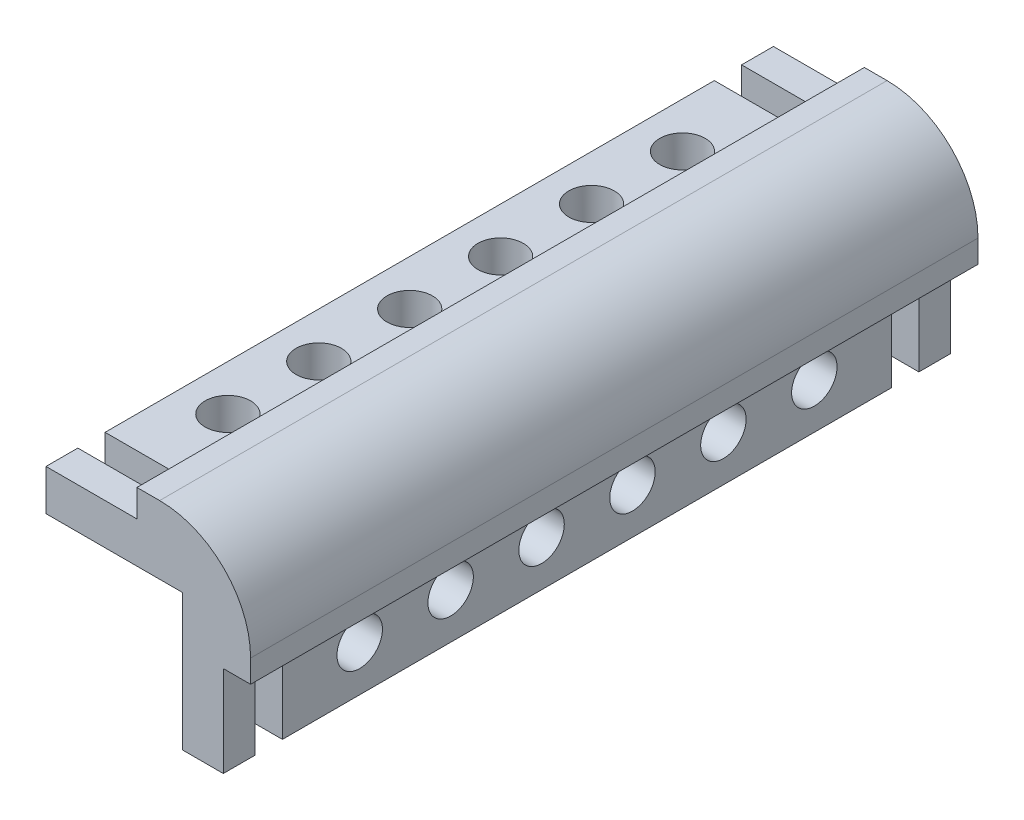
ISO-10303-21;
HEADER;
FILE_DESCRIPTION(('STEP AP214'),'2;1');
FILE_NAME('part.step','',(''),(''),'','','');
FILE_SCHEMA(('AUTOMOTIVE_DESIGN { 1 0 10303 214 1 1 1 1 }'));
ENDSEC;
DATA;
#1=APPLICATION_CONTEXT('core data for automotive mechanical design processes');
#2=APPLICATION_PROTOCOL_DEFINITION('international standard','automotive_design',2000,#1);
#3=PRODUCT_CONTEXT('',#1,'mechanical');
#4=PRODUCT('Part','Part','',(#3));
#5=PRODUCT_RELATED_PRODUCT_CATEGORY('part','',(#4));
#6=PRODUCT_DEFINITION_FORMATION('','',#4);
#7=PRODUCT_DEFINITION_CONTEXT('part definition',#1,'design');
#8=PRODUCT_DEFINITION('design','',#6,#7);
#9=PRODUCT_DEFINITION_SHAPE('','',#8);
#10=(LENGTH_UNIT() NAMED_UNIT(*) SI_UNIT(.MILLI.,.METRE.));
#11=(NAMED_UNIT(*) PLANE_ANGLE_UNIT() SI_UNIT($,.RADIAN.));
#12=(NAMED_UNIT(*) SI_UNIT($,.STERADIAN.) SOLID_ANGLE_UNIT());
#13=UNCERTAINTY_MEASURE_WITH_UNIT(LENGTH_MEASURE(1.E-05),#10,'distance_accuracy_value','');
#14=(GEOMETRIC_REPRESENTATION_CONTEXT(3) GLOBAL_UNCERTAINTY_ASSIGNED_CONTEXT((#13)) GLOBAL_UNIT_ASSIGNED_CONTEXT((#10,
#11,#12)) REPRESENTATION_CONTEXT('',''));
#15=CARTESIAN_POINT('',(0.,0.,0.));
#16=DIRECTION('',(0.,0.,1.));
#17=DIRECTION('',(1.,0.,0.));
#18=AXIS2_PLACEMENT_3D('',#15,#16,#17);
#19=CARTESIAN_POINT('',(30.,0.,80.));
#20=DIRECTION('',(1.,0.,0.));
#21=DIRECTION('',(0.,1.,0.));
#22=AXIS2_PLACEMENT_3D('',#19,#20,#21);
#23=PLANE('',#22);
#24=CARTESIAN_POINT('',(30.,-20.,10.));
#25=DIRECTION('',(1.,0.,0.));
#26=DIRECTION('',(0.,1.,0.));
#27=AXIS2_PLACEMENT_3D('',#24,#25,#26);
#28=CIRCLE('',#27,5.);
#29=CARTESIAN_POINT('',(30.,-15.,10.));
#30=VERTEX_POINT('',#29);
#31=EDGE_CURVE('E549',#30,#30,#28,.T.);
#32=ORIENTED_EDGE('',*,*,#31,.T.);
#33=EDGE_LOOP('',(#32));
#34=FACE_BOUND('',#33,.T.);
#35=CARTESIAN_POINT('',(30.,-20.,-10.));
#36=DIRECTION('',(1.,0.,0.));
#37=DIRECTION('',(0.,1.,0.));
#38=AXIS2_PLACEMENT_3D('',#35,#36,#37);
#39=CIRCLE('',#38,5.00000000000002);
#40=CARTESIAN_POINT('',(30.,-15.,-10.));
#41=VERTEX_POINT('',#40);
#42=EDGE_CURVE('E546',#41,#41,#39,.T.);
#43=ORIENTED_EDGE('',*,*,#42,.T.);
#44=EDGE_LOOP('',(#43));
#45=FACE_BOUND('',#44,.T.);
#46=CARTESIAN_POINT('',(30.,-20.,50.));
#47=DIRECTION('',(1.,0.,0.));
#48=DIRECTION('',(0.,1.,0.));
#49=AXIS2_PLACEMENT_3D('',#46,#47,#48);
#50=CIRCLE('',#49,4.99999999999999);
#51=CARTESIAN_POINT('',(30.,-15.,50.));
#52=VERTEX_POINT('',#51);
#53=EDGE_CURVE('E543',#52,#52,#50,.T.);
#54=ORIENTED_EDGE('',*,*,#53,.T.);
#55=EDGE_LOOP('',(#54));
#56=FACE_BOUND('',#55,.T.);
#57=CARTESIAN_POINT('',(30.,-20.,30.));
#58=DIRECTION('',(1.,0.,0.));
#59=DIRECTION('',(0.,1.,0.));
#60=AXIS2_PLACEMENT_3D('',#57,#58,#59);
#61=CIRCLE('',#60,4.99999999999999);
#62=CARTESIAN_POINT('',(30.,-15.,30.));
#63=VERTEX_POINT('',#62);
#64=EDGE_CURVE('E540',#63,#63,#61,.T.);
#65=ORIENTED_EDGE('',*,*,#64,.T.);
#66=EDGE_LOOP('',(#65));
#67=FACE_BOUND('',#66,.T.);
#68=CARTESIAN_POINT('',(30.,-20.,-30.));
#69=DIRECTION('',(1.,0.,0.));
#70=DIRECTION('',(0.,1.,0.));
#71=AXIS2_PLACEMENT_3D('',#68,#69,#70);
#72=CIRCLE('',#71,5.);
#73=CARTESIAN_POINT('',(30.,-15.,-30.));
#74=VERTEX_POINT('',#73);
#75=EDGE_CURVE('E535',#74,#74,#72,.T.);
#76=ORIENTED_EDGE('',*,*,#75,.T.);
#77=EDGE_LOOP('',(#76));
#78=FACE_BOUND('',#77,.T.);
#79=CARTESIAN_POINT('',(30.,-20.,-50.));
#80=DIRECTION('',(1.,0.,0.));
#81=DIRECTION('',(0.,1.,0.));
#82=AXIS2_PLACEMENT_3D('',#79,#80,#81);
#83=CIRCLE('',#82,5.);
#84=CARTESIAN_POINT('',(30.,-15.,-50.));
#85=VERTEX_POINT('',#84);
#86=EDGE_CURVE('E265',#85,#85,#83,.T.);
#87=ORIENTED_EDGE('',*,*,#86,.T.);
#88=EDGE_LOOP('',(#87));
#89=FACE_BOUND('',#88,.T.);
#90=DIRECTION('',(0.,1.,0.));
#91=VECTOR('',#90,1.);
#92=CARTESIAN_POINT('',(30.,0.,-67.));
#93=LINE('',#92,#91);
#94=CARTESIAN_POINT('',(30.,-30.,-67.));
#95=VERTEX_POINT('',#94);
#96=CARTESIAN_POINT('',(30.,0.,-67.));
#97=VERTEX_POINT('',#96);
#98=EDGE_CURVE('E456',#95,#97,#93,.T.);
#99=ORIENTED_EDGE('',*,*,#98,.F.);
#100=DIRECTION('',(0.,0.,-1.));
#101=VECTOR('',#100,1.);
#102=CARTESIAN_POINT('',(30.,-30.,80.));
#103=LINE('',#102,#101);
#104=CARTESIAN_POINT('',(30.,-30.,67.));
#105=VERTEX_POINT('',#104);
#106=EDGE_CURVE('E309',#105,#95,#103,.T.);
#107=ORIENTED_EDGE('',*,*,#106,.F.);
#108=DIRECTION('',(0.,1.,0.));
#109=VECTOR('',#108,1.);
#110=CARTESIAN_POINT('',(30.,0.,67.));
#111=LINE('',#110,#109);
#112=CARTESIAN_POINT('',(30.,0.,67.));
#113=VERTEX_POINT('',#112);
#114=EDGE_CURVE('E476',#105,#113,#111,.T.);
#115=ORIENTED_EDGE('',*,*,#114,.T.);
#116=DIRECTION('',(0.,0.,-1.));
#117=VECTOR('',#116,1.);
#118=CARTESIAN_POINT('',(30.,0.,80.));
#119=LINE('',#118,#117);
#120=EDGE_CURVE('E318',#113,#97,#119,.T.);
#121=ORIENTED_EDGE('',*,*,#120,.T.);
#122=EDGE_LOOP('',(#99,#107,#115,#121));
#123=FACE_BOUND('',#122,.T.);
#124=ADVANCED_FACE('F45',(#34,#45,#56,#67,#78,#89,#123),#23,.F.);
#125=CARTESIAN_POINT('',(45.,-30.,80.));
#126=DIRECTION('',(0.,-1.,0.));
#127=DIRECTION('',(1.,0.,0.));
#128=AXIS2_PLACEMENT_3D('',#125,#126,#127);
#129=PLANE('',#128);
#130=ORIENTED_EDGE('',*,*,#106,.T.);
#131=DIRECTION('',(1.,0.,0.));
#132=VECTOR('',#131,1.);
#133=CARTESIAN_POINT('',(45.,-30.,-67.));
#134=LINE('',#133,#132);
#135=CARTESIAN_POINT('',(39.,-30.,-67.));
#136=VERTEX_POINT('',#135);
#137=EDGE_CURVE('E458',#95,#136,#134,.T.);
#138=ORIENTED_EDGE('',*,*,#137,.T.);
#139=DIRECTION('',(0.,0.,1.));
#140=VECTOR('',#139,1.);
#141=CARTESIAN_POINT('',(39.,-30.,-80.));
#142=LINE('',#141,#140);
#143=CARTESIAN_POINT('',(39.,-30.,67.));
#144=VERTEX_POINT('',#143);
#145=EDGE_CURVE('E371',#136,#144,#142,.T.);
#146=ORIENTED_EDGE('',*,*,#145,.T.);
#147=DIRECTION('',(1.,0.,0.));
#148=VECTOR('',#147,1.);
#149=CARTESIAN_POINT('',(45.,-30.,67.));
#150=LINE('',#149,#148);
#151=EDGE_CURVE('E479',#105,#144,#150,.T.);
#152=ORIENTED_EDGE('',*,*,#151,.F.);
#153=EDGE_LOOP('',(#130,#138,#146,#152));
#154=FACE_BOUND('',#153,.T.);
#155=ADVANCED_FACE('F576',(#154),#129,.T.);
#156=CARTESIAN_POINT('',(0.,0.,80.));
#157=DIRECTION('',(-1.,0.,0.));
#158=DIRECTION('',(0.,0.,1.));
#159=AXIS2_PLACEMENT_3D('',#156,#157,#158);
#160=PLANE('',#159);
#161=DIRECTION('',(0.,0.,1.));
#162=VECTOR('',#161,1.);
#163=CARTESIAN_POINT('',(0.,9.,-80.));
#164=LINE('',#163,#162);
#165=CARTESIAN_POINT('',(0.,9.,-67.));
#166=VERTEX_POINT('',#165);
#167=CARTESIAN_POINT('',(0.,9.,67.));
#168=VERTEX_POINT('',#167);
#169=EDGE_CURVE('E248',#166,#168,#164,.T.);
#170=ORIENTED_EDGE('',*,*,#169,.F.);
#171=DIRECTION('',(0.,-1.,0.));
#172=VECTOR('',#171,1.);
#173=CARTESIAN_POINT('',(0.,48.4588393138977,-67.));
#174=LINE('',#173,#172);
#175=CARTESIAN_POINT('',(0.,0.,-67.));
#176=VERTEX_POINT('',#175);
#177=EDGE_CURVE('E242',#166,#176,#174,.T.);
#178=ORIENTED_EDGE('',*,*,#177,.T.);
#179=DIRECTION('',(0.,0.,-1.));
#180=VECTOR('',#179,1.);
#181=CARTESIAN_POINT('',(0.,0.,80.));
#182=LINE('',#181,#180);
#183=CARTESIAN_POINT('',(0.,0.,67.));
#184=VERTEX_POINT('',#183);
#185=EDGE_CURVE('E314',#184,#176,#182,.T.);
#186=ORIENTED_EDGE('',*,*,#185,.F.);
#187=DIRECTION('',(0.,-1.,0.));
#188=VECTOR('',#187,1.);
#189=CARTESIAN_POINT('',(0.,48.4588393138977,67.));
#190=LINE('',#189,#188);
#191=EDGE_CURVE('E443',#168,#184,#190,.T.);
#192=ORIENTED_EDGE('',*,*,#191,.F.);
#193=EDGE_LOOP('',(#170,#178,#186,#192));
#194=FACE_BOUND('',#193,.T.);
#195=ADVANCED_FACE('F442',(#194),#160,.T.);
#196=CARTESIAN_POINT('',(0.,0.,80.));
#197=DIRECTION('',(0.,1.,0.));
#198=DIRECTION('',(0.,0.,1.));
#199=AXIS2_PLACEMENT_3D('',#196,#197,#198);
#200=PLANE('',#199);
#201=CARTESIAN_POINT('',(9.99999999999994,0.,30.));
#202=DIRECTION('',(0.,1.,0.));
#203=DIRECTION('',(0.,0.,1.));
#204=AXIS2_PLACEMENT_3D('',#201,#202,#203);
#205=CIRCLE('',#204,5.);
#206=CARTESIAN_POINT('',(9.99999999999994,0.,35.));
#207=VERTEX_POINT('',#206);
#208=EDGE_CURVE('E513',#207,#207,#205,.T.);
#209=ORIENTED_EDGE('',*,*,#208,.T.);
#210=EDGE_LOOP('',(#209));
#211=FACE_BOUND('',#210,.T.);
#212=CARTESIAN_POINT('',(9.99999999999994,0.,9.99999999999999));
#213=DIRECTION('',(0.,1.,0.));
#214=DIRECTION('',(0.,0.,1.));
#215=AXIS2_PLACEMENT_3D('',#212,#213,#214);
#216=CIRCLE('',#215,5.);
#217=CARTESIAN_POINT('',(9.99999999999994,0.,15.));
#218=VERTEX_POINT('',#217);
#219=EDGE_CURVE('E510',#218,#218,#216,.T.);
#220=ORIENTED_EDGE('',*,*,#219,.T.);
#221=EDGE_LOOP('',(#220));
#222=FACE_BOUND('',#221,.T.);
#223=CARTESIAN_POINT('',(9.99999999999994,0.,-9.99999999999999));
#224=DIRECTION('',(0.,1.,0.));
#225=DIRECTION('',(0.,0.,1.));
#226=AXIS2_PLACEMENT_3D('',#223,#224,#225);
#227=CIRCLE('',#226,5.);
#228=CARTESIAN_POINT('',(9.99999999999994,0.,-4.99999999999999));
#229=VERTEX_POINT('',#228);
#230=EDGE_CURVE('E507',#229,#229,#227,.T.);
#231=ORIENTED_EDGE('',*,*,#230,.T.);
#232=EDGE_LOOP('',(#231));
#233=FACE_BOUND('',#232,.T.);
#234=CARTESIAN_POINT('',(9.99999999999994,0.,-30.));
#235=DIRECTION('',(0.,1.,0.));
#236=DIRECTION('',(0.,0.,1.));
#237=AXIS2_PLACEMENT_3D('',#234,#235,#236);
#238=CIRCLE('',#237,5.);
#239=CARTESIAN_POINT('',(9.99999999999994,0.,-25.));
#240=VERTEX_POINT('',#239);
#241=EDGE_CURVE('E504',#240,#240,#238,.T.);
#242=ORIENTED_EDGE('',*,*,#241,.T.);
#243=EDGE_LOOP('',(#242));
#244=FACE_BOUND('',#243,.T.);
#245=CARTESIAN_POINT('',(9.99999999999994,0.,-50.));
#246=DIRECTION('',(0.,1.,0.));
#247=DIRECTION('',(0.,0.,1.));
#248=AXIS2_PLACEMENT_3D('',#245,#246,#247);
#249=CIRCLE('',#248,5.);
#250=CARTESIAN_POINT('',(9.99999999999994,0.,-45.));
#251=VERTEX_POINT('',#250);
#252=EDGE_CURVE('E490',#251,#251,#249,.T.);
#253=ORIENTED_EDGE('',*,*,#252,.T.);
#254=EDGE_LOOP('',(#253));
#255=FACE_BOUND('',#254,.T.);
#256=CARTESIAN_POINT('',(9.99999999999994,0.,50.));
#257=DIRECTION('',(0.,1.,0.));
#258=DIRECTION('',(0.,0.,1.));
#259=AXIS2_PLACEMENT_3D('',#256,#257,#258);
#260=CIRCLE('',#259,5.);
#261=CARTESIAN_POINT('',(9.99999999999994,0.,55.));
#262=VERTEX_POINT('',#261);
#263=EDGE_CURVE('E519',#262,#262,#260,.T.);
#264=ORIENTED_EDGE('',*,*,#263,.T.);
#265=EDGE_LOOP('',(#264));
#266=FACE_BOUND('',#265,.T.);
#267=DIRECTION('',(-1.,0.,0.));
#268=VECTOR('',#267,1.);
#269=CARTESIAN_POINT('',(0.,0.,-67.));
#270=LINE('',#269,#268);
#271=EDGE_CURVE('E437',#97,#176,#270,.T.);
#272=ORIENTED_EDGE('',*,*,#271,.F.);
#273=ORIENTED_EDGE('',*,*,#120,.F.);
#274=DIRECTION('',(-1.,0.,0.));
#275=VECTOR('',#274,1.);
#276=CARTESIAN_POINT('',(0.,0.,67.));
#277=LINE('',#276,#275);
#278=EDGE_CURVE('E439',#113,#184,#277,.T.);
#279=ORIENTED_EDGE('',*,*,#278,.T.);
#280=ORIENTED_EDGE('',*,*,#185,.T.);
#281=EDGE_LOOP('',(#272,#273,#279,#280));
#282=FACE_BOUND('',#281,.T.);
#283=ADVANCED_FACE('F435',(#211,#222,#233,#244,#255,#266,#282),#200,.F.);
#284=CARTESIAN_POINT('',(39.,-9.99999999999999,-80.));
#285=DIRECTION('',(-1.,0.,0.));
#286=DIRECTION('',(0.,-1.,0.));
#287=AXIS2_PLACEMENT_3D('',#284,#285,#286);
#288=PLANE('',#287);
#289=CARTESIAN_POINT('',(39.,-20.,10.));
#290=DIRECTION('',(1.,0.,0.));
#291=DIRECTION('',(0.,-1.,0.));
#292=AXIS2_PLACEMENT_3D('',#289,#290,#291);
#293=CIRCLE('',#292,5.);
#294=CARTESIAN_POINT('',(39.,-25.,10.));
#295=VERTEX_POINT('',#294);
#296=EDGE_CURVE('E522',#295,#295,#293,.T.);
#297=ORIENTED_EDGE('',*,*,#296,.F.);
#298=EDGE_LOOP('',(#297));
#299=FACE_BOUND('',#298,.T.);
#300=CARTESIAN_POINT('',(39.,-20.,-10.));
#301=DIRECTION('',(1.,0.,0.));
#302=DIRECTION('',(0.,1.,0.));
#303=AXIS2_PLACEMENT_3D('',#300,#301,#302);
#304=CIRCLE('',#303,5.00000000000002);
#305=CARTESIAN_POINT('',(39.,-15.,-10.));
#306=VERTEX_POINT('',#305);
#307=EDGE_CURVE('E527',#306,#306,#304,.T.);
#308=ORIENTED_EDGE('',*,*,#307,.F.);
#309=EDGE_LOOP('',(#308));
#310=FACE_BOUND('',#309,.T.);
#311=CARTESIAN_POINT('',(39.,-20.,50.));
#312=DIRECTION('',(1.,0.,0.));
#313=DIRECTION('',(0.,-1.,0.));
#314=AXIS2_PLACEMENT_3D('',#311,#312,#313);
#315=CIRCLE('',#314,4.99999999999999);
#316=CARTESIAN_POINT('',(39.,-25.,50.));
#317=VERTEX_POINT('',#316);
#318=EDGE_CURVE('E523',#317,#317,#315,.T.);
#319=ORIENTED_EDGE('',*,*,#318,.F.);
#320=EDGE_LOOP('',(#319));
#321=FACE_BOUND('',#320,.T.);
#322=CARTESIAN_POINT('',(39.,-20.,30.));
#323=DIRECTION('',(1.,0.,0.));
#324=DIRECTION('',(0.,-1.,0.));
#325=AXIS2_PLACEMENT_3D('',#322,#323,#324);
#326=CIRCLE('',#325,4.99999999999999);
#327=CARTESIAN_POINT('',(39.,-25.,30.));
#328=VERTEX_POINT('',#327);
#329=EDGE_CURVE('E526',#328,#328,#326,.T.);
#330=ORIENTED_EDGE('',*,*,#329,.F.);
#331=EDGE_LOOP('',(#330));
#332=FACE_BOUND('',#331,.T.);
#333=CARTESIAN_POINT('',(39.,-20.,-30.));
#334=DIRECTION('',(1.,0.,0.));
#335=DIRECTION('',(0.,1.,0.));
#336=AXIS2_PLACEMENT_3D('',#333,#334,#335);
#337=CIRCLE('',#336,5.);
#338=CARTESIAN_POINT('',(39.,-15.,-30.));
#339=VERTEX_POINT('',#338);
#340=EDGE_CURVE('E532',#339,#339,#337,.T.);
#341=ORIENTED_EDGE('',*,*,#340,.F.);
#342=EDGE_LOOP('',(#341));
#343=FACE_BOUND('',#342,.T.);
#344=CARTESIAN_POINT('',(39.,-20.,-50.));
#345=DIRECTION('',(1.,0.,0.));
#346=DIRECTION('',(0.,1.,0.));
#347=AXIS2_PLACEMENT_3D('',#344,#345,#346);
#348=CIRCLE('',#347,5.);
#349=CARTESIAN_POINT('',(39.,-15.,-50.));
#350=VERTEX_POINT('',#349);
#351=EDGE_CURVE('E552',#350,#350,#348,.T.);
#352=ORIENTED_EDGE('',*,*,#351,.F.);
#353=EDGE_LOOP('',(#352));
#354=FACE_BOUND('',#353,.T.);
#355=DIRECTION('',(0.,-1.,0.));
#356=VECTOR('',#355,1.);
#357=CARTESIAN_POINT('',(39.,48.4588393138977,-67.));
#358=LINE('',#357,#356);
#359=CARTESIAN_POINT('',(39.,-9.99999999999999,-67.));
#360=VERTEX_POINT('',#359);
#361=EDGE_CURVE('E605',#360,#136,#358,.T.);
#362=ORIENTED_EDGE('',*,*,#361,.F.);
#363=DIRECTION('',(0.,0.,1.));
#364=VECTOR('',#363,1.);
#365=CARTESIAN_POINT('',(39.,-9.99999999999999,-80.));
#366=LINE('',#365,#364);
#367=CARTESIAN_POINT('',(39.,-9.99999999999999,67.));
#368=VERTEX_POINT('',#367);
#369=EDGE_CURVE('E367',#360,#368,#366,.T.);
#370=ORIENTED_EDGE('',*,*,#369,.T.);
#371=DIRECTION('',(0.,-1.,0.));
#372=VECTOR('',#371,1.);
#373=CARTESIAN_POINT('',(39.,48.4588393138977,67.));
#374=LINE('',#373,#372);
#375=EDGE_CURVE('E461',#368,#144,#374,.T.);
#376=ORIENTED_EDGE('',*,*,#375,.T.);
#377=ORIENTED_EDGE('',*,*,#145,.F.);
#378=EDGE_LOOP('',(#362,#370,#376,#377));
#379=FACE_BOUND('',#378,.T.);
#380=ADVANCED_FACE('F695',(#299,#310,#321,#332,#343,#354,#379),#288,.F.);
#381=CARTESIAN_POINT('',(0.,9.,-80.));
#382=DIRECTION('',(0.,-1.,0.));
#383=DIRECTION('',(0.,0.,-1.));
#384=AXIS2_PLACEMENT_3D('',#381,#382,#383);
#385=PLANE('',#384);
#386=CARTESIAN_POINT('',(9.99999999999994,9.,30.));
#387=DIRECTION('',(0.,1.,0.));
#388=DIRECTION('',(0.,0.,1.));
#389=AXIS2_PLACEMENT_3D('',#386,#387,#388);
#390=CIRCLE('',#389,5.);
#391=CARTESIAN_POINT('',(9.99999999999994,9.,35.));
#392=VERTEX_POINT('',#391);
#393=EDGE_CURVE('E487',#392,#392,#390,.T.);
#394=ORIENTED_EDGE('',*,*,#393,.F.);
#395=EDGE_LOOP('',(#394));
#396=FACE_BOUND('',#395,.T.);
#397=CARTESIAN_POINT('',(9.99999999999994,9.,9.99999999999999));
#398=DIRECTION('',(0.,1.,0.));
#399=DIRECTION('',(0.,0.,1.));
#400=AXIS2_PLACEMENT_3D('',#397,#398,#399);
#401=CIRCLE('',#400,5.);
#402=CARTESIAN_POINT('',(9.99999999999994,9.,15.));
#403=VERTEX_POINT('',#402);
#404=EDGE_CURVE('E491',#403,#403,#401,.T.);
#405=ORIENTED_EDGE('',*,*,#404,.F.);
#406=EDGE_LOOP('',(#405));
#407=FACE_BOUND('',#406,.T.);
#408=CARTESIAN_POINT('',(9.99999999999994,9.,-9.99999999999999));
#409=DIRECTION('',(0.,1.,0.));
#410=DIRECTION('',(0.,0.,-1.));
#411=AXIS2_PLACEMENT_3D('',#408,#409,#410);
#412=CIRCLE('',#411,5.);
#413=CARTESIAN_POINT('',(9.99999999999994,9.,-15.));
#414=VERTEX_POINT('',#413);
#415=EDGE_CURVE('E494',#414,#414,#412,.T.);
#416=ORIENTED_EDGE('',*,*,#415,.F.);
#417=EDGE_LOOP('',(#416));
#418=FACE_BOUND('',#417,.T.);
#419=CARTESIAN_POINT('',(9.99999999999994,9.,-30.));
#420=DIRECTION('',(0.,1.,0.));
#421=DIRECTION('',(0.,0.,-1.));
#422=AXIS2_PLACEMENT_3D('',#419,#420,#421);
#423=CIRCLE('',#422,5.);
#424=CARTESIAN_POINT('',(9.99999999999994,9.,-35.));
#425=VERTEX_POINT('',#424);
#426=EDGE_CURVE('E497',#425,#425,#423,.T.);
#427=ORIENTED_EDGE('',*,*,#426,.F.);
#428=EDGE_LOOP('',(#427));
#429=FACE_BOUND('',#428,.T.);
#430=CARTESIAN_POINT('',(9.99999999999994,9.,-50.));
#431=DIRECTION('',(0.,1.,0.));
#432=DIRECTION('',(0.,0.,-1.));
#433=AXIS2_PLACEMENT_3D('',#430,#431,#432);
#434=CIRCLE('',#433,5.);
#435=CARTESIAN_POINT('',(9.99999999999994,9.,-55.));
#436=VERTEX_POINT('',#435);
#437=EDGE_CURVE('E486',#436,#436,#434,.T.);
#438=ORIENTED_EDGE('',*,*,#437,.F.);
#439=EDGE_LOOP('',(#438));
#440=FACE_BOUND('',#439,.T.);
#441=CARTESIAN_POINT('',(9.99999999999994,9.,50.));
#442=DIRECTION('',(0.,1.,0.));
#443=DIRECTION('',(0.,0.,1.));
#444=AXIS2_PLACEMENT_3D('',#441,#442,#443);
#445=CIRCLE('',#444,5.);
#446=CARTESIAN_POINT('',(9.99999999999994,9.,55.));
#447=VERTEX_POINT('',#446);
#448=EDGE_CURVE('E516',#447,#447,#445,.T.);
#449=ORIENTED_EDGE('',*,*,#448,.F.);
#450=EDGE_LOOP('',(#449));
#451=FACE_BOUND('',#450,.T.);
#452=DIRECTION('',(1.,0.,0.));
#453=VECTOR('',#452,1.);
#454=CARTESIAN_POINT('',(0.,9.,-67.));
#455=LINE('',#454,#453);
#456=CARTESIAN_POINT('',(20.,9.,-67.));
#457=VERTEX_POINT('',#456);
#458=EDGE_CURVE('E13',#166,#457,#455,.T.);
#459=ORIENTED_EDGE('',*,*,#458,.F.);
#460=ORIENTED_EDGE('',*,*,#169,.T.);
#461=DIRECTION('',(1.,0.,0.));
#462=VECTOR('',#461,1.);
#463=CARTESIAN_POINT('',(0.,9.,67.));
#464=LINE('',#463,#462);
#465=CARTESIAN_POINT('',(20.,9.,67.));
#466=VERTEX_POINT('',#465);
#467=EDGE_CURVE('E287',#168,#466,#464,.T.);
#468=ORIENTED_EDGE('',*,*,#467,.T.);
#469=DIRECTION('',(0.,0.,1.));
#470=VECTOR('',#469,1.);
#471=CARTESIAN_POINT('',(20.,9.,-80.));
#472=LINE('',#471,#470);
#473=EDGE_CURVE('E68',#457,#466,#472,.T.);
#474=ORIENTED_EDGE('',*,*,#473,.F.);
#475=EDGE_LOOP('',(#459,#460,#468,#474));
#476=FACE_BOUND('',#475,.T.);
#477=ADVANCED_FACE('F289',(#396,#407,#418,#429,#440,#451,#476),#385,.F.);
#478=DIRECTION('',(0.,1.,0.));
#479=VECTOR('',#478,1.);
#480=CARTESIAN_POINT('',(30.,0.,73.));
#481=LINE('',#480,#479);
#482=CARTESIAN_POINT('',(30.,-30.,73.));
#483=VERTEX_POINT('',#482);
#484=CARTESIAN_POINT('',(30.,0.,73.));
#485=VERTEX_POINT('',#484);
#486=EDGE_CURVE('E398',#483,#485,#481,.T.);
#487=ORIENTED_EDGE('',*,*,#486,.F.);
#488=CARTESIAN_POINT('',(30.,-30.,80.));
#489=VERTEX_POINT('',#488);
#490=EDGE_CURVE('E306',#489,#483,#103,.T.);
#491=ORIENTED_EDGE('',*,*,#490,.F.);
#492=DIRECTION('',(0.,-1.,0.));
#493=VECTOR('',#492,1.);
#494=CARTESIAN_POINT('',(30.,0.,80.));
#495=LINE('',#494,#493);
#496=CARTESIAN_POINT('',(30.,0.,80.));
#497=VERTEX_POINT('',#496);
#498=EDGE_CURVE('E323',#497,#489,#495,.T.);
#499=ORIENTED_EDGE('',*,*,#498,.F.);
#500=EDGE_CURVE('E315',#497,#485,#119,.T.);
#501=ORIENTED_EDGE('',*,*,#500,.T.);
#502=EDGE_LOOP('',(#487,#491,#499,#501));
#503=FACE_BOUND('',#502,.T.);
#504=ADVANCED_FACE('F397',(#503),#23,.F.);
#505=ORIENTED_EDGE('',*,*,#490,.T.);
#506=DIRECTION('',(1.,0.,0.));
#507=VECTOR('',#506,1.);
#508=CARTESIAN_POINT('',(45.,-30.,73.));
#509=LINE('',#508,#507);
#510=CARTESIAN_POINT('',(39.,-30.,73.));
#511=VERTEX_POINT('',#510);
#512=EDGE_CURVE('E402',#483,#511,#509,.T.);
#513=ORIENTED_EDGE('',*,*,#512,.T.);
#514=CARTESIAN_POINT('',(39.,-30.,80.));
#515=VERTEX_POINT('',#514);
#516=EDGE_CURVE('E365',#511,#515,#142,.T.);
#517=ORIENTED_EDGE('',*,*,#516,.T.);
#518=DIRECTION('',(-1.,0.,0.));
#519=VECTOR('',#518,1.);
#520=CARTESIAN_POINT('',(45.,-30.,80.));
#521=LINE('',#520,#519);
#522=EDGE_CURVE('E348',#515,#489,#521,.T.);
#523=ORIENTED_EDGE('',*,*,#522,.T.);
#524=EDGE_LOOP('',(#505,#513,#517,#523));
#525=FACE_BOUND('',#524,.T.);
#526=ADVANCED_FACE('F401',(#525),#129,.T.);
#527=CARTESIAN_POINT('',(0.,9.,73.));
#528=VERTEX_POINT('',#527);
#529=CARTESIAN_POINT('',(0.,9.,80.));
#530=VERTEX_POINT('',#529);
#531=EDGE_CURVE('E250',#528,#530,#164,.T.);
#532=ORIENTED_EDGE('',*,*,#531,.F.);
#533=DIRECTION('',(0.,-1.,0.));
#534=VECTOR('',#533,1.);
#535=CARTESIAN_POINT('',(0.,48.4588393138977,73.));
#536=LINE('',#535,#534);
#537=CARTESIAN_POINT('',(0.,0.,73.));
#538=VERTEX_POINT('',#537);
#539=EDGE_CURVE('E387',#528,#538,#536,.T.);
#540=ORIENTED_EDGE('',*,*,#539,.T.);
#541=CARTESIAN_POINT('',(0.,0.,80.));
#542=VERTEX_POINT('',#541);
#543=EDGE_CURVE('E311',#542,#538,#182,.T.);
#544=ORIENTED_EDGE('',*,*,#543,.F.);
#545=DIRECTION('',(0.,1.,0.));
#546=VECTOR('',#545,1.);
#547=CARTESIAN_POINT('',(0.,0.,80.));
#548=LINE('',#547,#546);
#549=EDGE_CURVE('E340',#542,#530,#548,.T.);
#550=ORIENTED_EDGE('',*,*,#549,.T.);
#551=EDGE_LOOP('',(#532,#540,#544,#550));
#552=FACE_BOUND('',#551,.T.);
#553=ADVANCED_FACE('F384',(#552),#160,.T.);
#554=DIRECTION('',(-1.,0.,0.));
#555=VECTOR('',#554,1.);
#556=CARTESIAN_POINT('',(0.,0.,73.));
#557=LINE('',#556,#555);
#558=EDGE_CURVE('E482',#485,#538,#557,.T.);
#559=ORIENTED_EDGE('',*,*,#558,.F.);
#560=ORIENTED_EDGE('',*,*,#500,.F.);
#561=DIRECTION('',(1.,0.,0.));
#562=VECTOR('',#561,1.);
#563=CARTESIAN_POINT('',(0.,0.,80.));
#564=LINE('',#563,#562);
#565=EDGE_CURVE('E338',#542,#497,#564,.T.);
#566=ORIENTED_EDGE('',*,*,#565,.F.);
#567=ORIENTED_EDGE('',*,*,#543,.T.);
#568=EDGE_LOOP('',(#559,#560,#566,#567));
#569=FACE_BOUND('',#568,.T.);
#570=ADVANCED_FACE('F391',(#569),#200,.F.);
#571=DIRECTION('',(0.,-1.,0.));
#572=VECTOR('',#571,1.);
#573=CARTESIAN_POINT('',(39.,48.4588393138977,73.));
#574=LINE('',#573,#572);
#575=CARTESIAN_POINT('',(39.,-9.99999999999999,73.));
#576=VERTEX_POINT('',#575);
#577=EDGE_CURVE('E470',#576,#511,#574,.T.);
#578=ORIENTED_EDGE('',*,*,#577,.F.);
#579=CARTESIAN_POINT('',(39.,-9.99999999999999,80.));
#580=VERTEX_POINT('',#579);
#581=EDGE_CURVE('E360',#576,#580,#366,.T.);
#582=ORIENTED_EDGE('',*,*,#581,.T.);
#583=DIRECTION('',(0.,1.,0.));
#584=VECTOR('',#583,1.);
#585=CARTESIAN_POINT('',(39.,0.,80.));
#586=LINE('',#585,#584);
#587=EDGE_CURVE('E337',#515,#580,#586,.T.);
#588=ORIENTED_EDGE('',*,*,#587,.F.);
#589=ORIENTED_EDGE('',*,*,#516,.F.);
#590=EDGE_LOOP('',(#578,#582,#588,#589));
#591=FACE_BOUND('',#590,.T.);
#592=ADVANCED_FACE('F407',(#591),#288,.F.);
#593=DIRECTION('',(1.,0.,0.));
#594=VECTOR('',#593,1.);
#595=CARTESIAN_POINT('',(0.,9.,73.));
#596=LINE('',#595,#594);
#597=CARTESIAN_POINT('',(20.,9.,73.));
#598=VERTEX_POINT('',#597);
#599=EDGE_CURVE('E232',#528,#598,#596,.T.);
#600=ORIENTED_EDGE('',*,*,#599,.F.);
#601=ORIENTED_EDGE('',*,*,#531,.T.);
#602=DIRECTION('',(-1.,0.,0.));
#603=VECTOR('',#602,1.);
#604=CARTESIAN_POINT('',(0.,9.,80.));
#605=LINE('',#604,#603);
#606=CARTESIAN_POINT('',(20.,9.,80.));
#607=VERTEX_POINT('',#606);
#608=EDGE_CURVE('E271',#607,#530,#605,.T.);
#609=ORIENTED_EDGE('',*,*,#608,.F.);
#610=EDGE_CURVE('E247',#598,#607,#472,.T.);
#611=ORIENTED_EDGE('',*,*,#610,.F.);
#612=EDGE_LOOP('',(#600,#601,#609,#611));
#613=FACE_BOUND('',#612,.T.);
#614=ADVANCED_FACE('F572',(#613),#385,.F.);
#615=CARTESIAN_POINT('',(30.,-30.,-73.));
#616=VERTEX_POINT('',#615);
#617=CARTESIAN_POINT('',(30.,-30.,-80.));
#618=VERTEX_POINT('',#617);
#619=EDGE_CURVE('E310',#616,#618,#103,.T.);
#620=ORIENTED_EDGE('',*,*,#619,.F.);
#621=DIRECTION('',(0.,1.,0.));
#622=VECTOR('',#621,1.);
#623=CARTESIAN_POINT('',(30.,0.,-73.));
#624=LINE('',#623,#622);
#625=CARTESIAN_POINT('',(30.,0.,-73.));
#626=VERTEX_POINT('',#625);
#627=EDGE_CURVE('E449',#616,#626,#624,.T.);
#628=ORIENTED_EDGE('',*,*,#627,.T.);
#629=CARTESIAN_POINT('',(30.,0.,-80.));
#630=VERTEX_POINT('',#629);
#631=EDGE_CURVE('E319',#626,#630,#119,.T.);
#632=ORIENTED_EDGE('',*,*,#631,.T.);
#633=DIRECTION('',(0.,-1.,0.));
#634=VECTOR('',#633,1.);
#635=CARTESIAN_POINT('',(30.,0.,-80.));
#636=LINE('',#635,#634);
#637=EDGE_CURVE('E334',#630,#618,#636,.T.);
#638=ORIENTED_EDGE('',*,*,#637,.T.);
#639=EDGE_LOOP('',(#620,#628,#632,#638));
#640=FACE_BOUND('',#639,.T.);
#641=ADVANCED_FACE('F578',(#640),#23,.F.);
#642=DIRECTION('',(1.,0.,0.));
#643=VECTOR('',#642,1.);
#644=CARTESIAN_POINT('',(45.,-30.,-73.0000000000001));
#645=LINE('',#644,#643);
#646=CARTESIAN_POINT('',(39.,-30.,-73.));
#647=VERTEX_POINT('',#646);
#648=EDGE_CURVE('E453',#616,#647,#645,.T.);
#649=ORIENTED_EDGE('',*,*,#648,.F.);
#650=ORIENTED_EDGE('',*,*,#619,.T.);
#651=DIRECTION('',(-1.,0.,0.));
#652=VECTOR('',#651,1.);
#653=CARTESIAN_POINT('',(45.,-30.,-80.));
#654=LINE('',#653,#652);
#655=CARTESIAN_POINT('',(39.,-30.,-80.));
#656=VERTEX_POINT('',#655);
#657=EDGE_CURVE('E331',#656,#618,#654,.T.);
#658=ORIENTED_EDGE('',*,*,#657,.F.);
#659=EDGE_CURVE('E357',#656,#647,#142,.T.);
#660=ORIENTED_EDGE('',*,*,#659,.T.);
#661=EDGE_LOOP('',(#649,#650,#658,#660));
#662=FACE_BOUND('',#661,.T.);
#663=ADVANCED_FACE('F584',(#662),#129,.T.);
#664=CARTESIAN_POINT('',(45.,0.,80.));
#665=DIRECTION('',(1.,0.,0.));
#666=DIRECTION('',(0.,1.,0.));
#667=AXIS2_PLACEMENT_3D('',#664,#665,#666);
#668=PLANE('',#667);
#669=DIRECTION('',(0.,0.,1.));
#670=VECTOR('',#669,1.);
#671=CARTESIAN_POINT('',(45.,-9.99999999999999,-80.));
#672=LINE('',#671,#670);
#673=CARTESIAN_POINT('',(45.,-9.99999999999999,-80.));
#674=VERTEX_POINT('',#673);
#675=CARTESIAN_POINT('',(45.,-9.99999999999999,80.));
#676=VERTEX_POINT('',#675);
#677=EDGE_CURVE('E358',#674,#676,#672,.T.);
#678=ORIENTED_EDGE('',*,*,#677,.F.);
#679=DIRECTION('',(0.,-1.,0.));
#680=VECTOR('',#679,1.);
#681=CARTESIAN_POINT('',(45.,0.,-80.));
#682=LINE('',#681,#680);
#683=CARTESIAN_POINT('',(45.,-4.99999999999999,-80.));
#684=VERTEX_POINT('',#683);
#685=EDGE_CURVE('E328',#684,#674,#682,.T.);
#686=ORIENTED_EDGE('',*,*,#685,.F.);
#687=DIRECTION('',(0.,0.,-1.));
#688=VECTOR('',#687,1.);
#689=CARTESIAN_POINT('',(45.,-4.99999999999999,80.));
#690=LINE('',#689,#688);
#691=CARTESIAN_POINT('',(45.,-4.99999999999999,80.));
#692=VERTEX_POINT('',#691);
#693=EDGE_CURVE('E297',#684,#692,#690,.F.);
#694=ORIENTED_EDGE('',*,*,#693,.T.);
#695=DIRECTION('',(0.,-1.,0.));
#696=VECTOR('',#695,1.);
#697=CARTESIAN_POINT('',(45.,0.,80.));
#698=LINE('',#697,#696);
#699=EDGE_CURVE('E345',#692,#676,#698,.T.);
#700=ORIENTED_EDGE('',*,*,#699,.T.);
#701=EDGE_LOOP('',(#678,#686,#694,#700));
#702=FACE_BOUND('',#701,.T.);
#703=ADVANCED_FACE('F415',(#702),#668,.T.);
#704=CARTESIAN_POINT('',(0.,15.,80.));
#705=DIRECTION('',(0.,1.,0.));
#706=DIRECTION('',(0.,0.,1.));
#707=AXIS2_PLACEMENT_3D('',#704,#705,#706);
#708=PLANE('',#707);
#709=DIRECTION('',(0.,0.,1.));
#710=VECTOR('',#709,1.);
#711=CARTESIAN_POINT('',(20.,15.,-80.));
#712=LINE('',#711,#710);
#713=CARTESIAN_POINT('',(20.,15.,-80.));
#714=VERTEX_POINT('',#713);
#715=CARTESIAN_POINT('',(20.,15.,80.));
#716=VERTEX_POINT('',#715);
#717=EDGE_CURVE('E269',#714,#716,#712,.T.);
#718=ORIENTED_EDGE('',*,*,#717,.T.);
#719=DIRECTION('',(1.,0.,0.));
#720=VECTOR('',#719,1.);
#721=CARTESIAN_POINT('',(0.,15.,80.));
#722=LINE('',#721,#720);
#723=CARTESIAN_POINT('',(25.,15.,80.));
#724=VERTEX_POINT('',#723);
#725=EDGE_CURVE('E343',#716,#724,#722,.T.);
#726=ORIENTED_EDGE('',*,*,#725,.T.);
#727=DIRECTION('',(0.,0.,-1.));
#728=VECTOR('',#727,1.);
#729=CARTESIAN_POINT('',(25.,15.,80.));
#730=LINE('',#729,#728);
#731=CARTESIAN_POINT('',(25.,15.,-80.));
#732=VERTEX_POINT('',#731);
#733=EDGE_CURVE('E303',#724,#732,#730,.T.);
#734=ORIENTED_EDGE('',*,*,#733,.T.);
#735=DIRECTION('',(1.,0.,0.));
#736=VECTOR('',#735,1.);
#737=CARTESIAN_POINT('',(0.,15.,-80.));
#738=LINE('',#737,#736);
#739=EDGE_CURVE('E326',#714,#732,#738,.T.);
#740=ORIENTED_EDGE('',*,*,#739,.F.);
#741=EDGE_LOOP('',(#718,#726,#734,#740));
#742=FACE_BOUND('',#741,.T.);
#743=ADVANCED_FACE('F422',(#742),#708,.T.);
#744=DIRECTION('',(0.,-1.,0.));
#745=VECTOR('',#744,1.);
#746=CARTESIAN_POINT('',(0.,48.4588393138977,-73.));
#747=LINE('',#746,#745);
#748=CARTESIAN_POINT('',(0.,9.,-73.));
#749=VERTEX_POINT('',#748);
#750=CARTESIAN_POINT('',(0.,0.,-73.));
#751=VERTEX_POINT('',#750);
#752=EDGE_CURVE('E226',#749,#751,#747,.T.);
#753=ORIENTED_EDGE('',*,*,#752,.F.);
#754=CARTESIAN_POINT('',(0.,9.,-80.));
#755=VERTEX_POINT('',#754);
#756=EDGE_CURVE('E238',#755,#749,#164,.T.);
#757=ORIENTED_EDGE('',*,*,#756,.F.);
#758=DIRECTION('',(0.,1.,0.));
#759=VECTOR('',#758,1.);
#760=CARTESIAN_POINT('',(0.,0.,-80.));
#761=LINE('',#760,#759);
#762=CARTESIAN_POINT('',(0.,0.,-80.));
#763=VERTEX_POINT('',#762);
#764=EDGE_CURVE('E324',#763,#755,#761,.T.);
#765=ORIENTED_EDGE('',*,*,#764,.F.);
#766=EDGE_CURVE('E240',#751,#763,#182,.T.);
#767=ORIENTED_EDGE('',*,*,#766,.F.);
#768=EDGE_LOOP('',(#753,#757,#765,#767));
#769=FACE_BOUND('',#768,.T.);
#770=ADVANCED_FACE('F236',(#769),#160,.T.);
#771=ORIENTED_EDGE('',*,*,#631,.F.);
#772=DIRECTION('',(-1.,0.,0.));
#773=VECTOR('',#772,1.);
#774=CARTESIAN_POINT('',(0.,0.,-73.));
#775=LINE('',#774,#773);
#776=EDGE_CURVE('E429',#626,#751,#775,.T.);
#777=ORIENTED_EDGE('',*,*,#776,.T.);
#778=ORIENTED_EDGE('',*,*,#766,.T.);
#779=DIRECTION('',(1.,0.,0.));
#780=VECTOR('',#779,1.);
#781=CARTESIAN_POINT('',(0.,0.,-80.));
#782=LINE('',#781,#780);
#783=EDGE_CURVE('E320',#763,#630,#782,.T.);
#784=ORIENTED_EDGE('',*,*,#783,.T.);
#785=EDGE_LOOP('',(#771,#777,#778,#784));
#786=FACE_BOUND('',#785,.T.);
#787=ADVANCED_FACE('F428',(#786),#200,.F.);
#788=CARTESIAN_POINT('',(0.,0.,80.));
#789=DIRECTION('',(0.,0.,-1.));
#790=DIRECTION('',(-1.,0.,0.));
#791=AXIS2_PLACEMENT_3D('',#788,#789,#790);
#792=PLANE('',#791);
#793=ORIENTED_EDGE('',*,*,#725,.F.);
#794=DIRECTION('',(0.,-1.,0.));
#795=VECTOR('',#794,1.);
#796=CARTESIAN_POINT('',(20.,0.,80.));
#797=LINE('',#796,#795);
#798=EDGE_CURVE('E377',#716,#607,#797,.T.);
#799=ORIENTED_EDGE('',*,*,#798,.T.);
#800=ORIENTED_EDGE('',*,*,#608,.T.);
#801=ORIENTED_EDGE('',*,*,#549,.F.);
#802=ORIENTED_EDGE('',*,*,#565,.T.);
#803=ORIENTED_EDGE('',*,*,#498,.T.);
#804=ORIENTED_EDGE('',*,*,#522,.F.);
#805=ORIENTED_EDGE('',*,*,#587,.T.);
#806=DIRECTION('',(1.,0.,0.));
#807=VECTOR('',#806,1.);
#808=CARTESIAN_POINT('',(0.,-9.99999999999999,80.));
#809=LINE('',#808,#807);
#810=EDGE_CURVE('E354',#580,#676,#809,.T.);
#811=ORIENTED_EDGE('',*,*,#810,.T.);
#812=ORIENTED_EDGE('',*,*,#699,.F.);
#813=CARTESIAN_POINT('',(25.,-5.,80.));
#814=DIRECTION('',(0.,0.,-1.));
#815=DIRECTION('',(-1.,0.,0.));
#816=AXIS2_PLACEMENT_3D('',#813,#814,#815);
#817=CIRCLE('',#816,20.);
#818=EDGE_CURVE('E293',#692,#724,#817,.F.);
#819=ORIENTED_EDGE('',*,*,#818,.T.);
#820=EDGE_LOOP('',(#793,#799,#800,#801,#802,#803,#804,#805,#811,#812,#819));
#821=FACE_BOUND('',#820,.T.);
#822=ADVANCED_FACE('F382',(#821),#792,.F.);
#823=CARTESIAN_POINT('',(0.,0.,-80.));
#824=DIRECTION('',(0.,0.,-1.));
#825=DIRECTION('',(-1.,0.,0.));
#826=AXIS2_PLACEMENT_3D('',#823,#824,#825);
#827=PLANE('',#826);
#828=DIRECTION('',(0.,1.,0.));
#829=VECTOR('',#828,1.);
#830=CARTESIAN_POINT('',(20.,15.,-80.));
#831=LINE('',#830,#829);
#832=CARTESIAN_POINT('',(20.,9.,-80.));
#833=VERTEX_POINT('',#832);
#834=EDGE_CURVE('E255',#833,#714,#831,.T.);
#835=ORIENTED_EDGE('',*,*,#834,.T.);
#836=ORIENTED_EDGE('',*,*,#739,.T.);
#837=CARTESIAN_POINT('',(25.,-5.,-80.));
#838=DIRECTION('',(0.,0.,-1.));
#839=DIRECTION('',(-1.,0.,0.));
#840=AXIS2_PLACEMENT_3D('',#837,#838,#839);
#841=CIRCLE('',#840,20.);
#842=EDGE_CURVE('E301',#732,#684,#841,.T.);
#843=ORIENTED_EDGE('',*,*,#842,.T.);
#844=ORIENTED_EDGE('',*,*,#685,.T.);
#845=DIRECTION('',(-1.,0.,0.));
#846=VECTOR('',#845,1.);
#847=CARTESIAN_POINT('',(45.,-9.99999999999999,-80.));
#848=LINE('',#847,#846);
#849=CARTESIAN_POINT('',(39.,-9.99999999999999,-80.));
#850=VERTEX_POINT('',#849);
#851=EDGE_CURVE('E374',#674,#850,#848,.T.);
#852=ORIENTED_EDGE('',*,*,#851,.T.);
#853=DIRECTION('',(0.,-1.,0.));
#854=VECTOR('',#853,1.);
#855=CARTESIAN_POINT('',(39.,-9.99999999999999,-80.));
#856=LINE('',#855,#854);
#857=EDGE_CURVE('E361',#850,#656,#856,.T.);
#858=ORIENTED_EDGE('',*,*,#857,.T.);
#859=ORIENTED_EDGE('',*,*,#657,.T.);
#860=ORIENTED_EDGE('',*,*,#637,.F.);
#861=ORIENTED_EDGE('',*,*,#783,.F.);
#862=ORIENTED_EDGE('',*,*,#764,.T.);
#863=DIRECTION('',(1.,0.,0.));
#864=VECTOR('',#863,1.);
#865=CARTESIAN_POINT('',(0.,9.,-80.));
#866=LINE('',#865,#864);
#867=EDGE_CURVE('E246',#755,#833,#866,.T.);
#868=ORIENTED_EDGE('',*,*,#867,.T.);
#869=EDGE_LOOP('',(#835,#836,#843,#844,#852,#858,#859,#860,#861,#862,#868));
#870=FACE_BOUND('',#869,.T.);
#871=ADVANCED_FACE('F423',(#870),#827,.T.);
#872=CARTESIAN_POINT('',(25.,-5.,80.));
#873=DIRECTION('',(0.,0.,-1.));
#874=DIRECTION('',(-1.,0.,0.));
#875=AXIS2_PLACEMENT_3D('',#872,#873,#874);
#876=CYLINDRICAL_SURFACE('',#875,20.);
#877=ORIENTED_EDGE('',*,*,#818,.F.);
#878=ORIENTED_EDGE('',*,*,#693,.F.);
#879=ORIENTED_EDGE('',*,*,#842,.F.);
#880=ORIENTED_EDGE('',*,*,#733,.F.);
#881=EDGE_LOOP('',(#877,#878,#879,#880));
#882=FACE_BOUND('',#881,.T.);
#883=ADVANCED_FACE('F47',(#882),#876,.T.);
#884=CARTESIAN_POINT('',(39.,-9.99999999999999,-73.));
#885=VERTEX_POINT('',#884);
#886=EDGE_CURVE('E362',#850,#885,#366,.T.);
#887=ORIENTED_EDGE('',*,*,#886,.T.);
#888=DIRECTION('',(0.,-1.,0.));
#889=VECTOR('',#888,1.);
#890=CARTESIAN_POINT('',(39.,48.4588393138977,-73.));
#891=LINE('',#890,#889);
#892=EDGE_CURVE('E241',#885,#647,#891,.T.);
#893=ORIENTED_EDGE('',*,*,#892,.T.);
#894=ORIENTED_EDGE('',*,*,#659,.F.);
#895=ORIENTED_EDGE('',*,*,#857,.F.);
#896=EDGE_LOOP('',(#887,#893,#894,#895));
#897=FACE_BOUND('',#896,.T.);
#898=ADVANCED_FACE('F626',(#897),#288,.F.);
#899=CARTESIAN_POINT('',(45.,-9.99999999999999,-80.));
#900=DIRECTION('',(0.,1.,0.));
#901=DIRECTION('',(0.,0.,1.));
#902=AXIS2_PLACEMENT_3D('',#899,#900,#901);
#903=PLANE('',#902);
#904=ORIENTED_EDGE('',*,*,#886,.F.);
#905=ORIENTED_EDGE('',*,*,#851,.F.);
#906=ORIENTED_EDGE('',*,*,#677,.T.);
#907=ORIENTED_EDGE('',*,*,#810,.F.);
#908=ORIENTED_EDGE('',*,*,#581,.F.);
#909=EDGE_CURVE('E368',#368,#576,#366,.T.);
#910=ORIENTED_EDGE('',*,*,#909,.F.);
#911=ORIENTED_EDGE('',*,*,#369,.F.);
#912=EDGE_CURVE('E366',#885,#360,#366,.T.);
#913=ORIENTED_EDGE('',*,*,#912,.F.);
#914=EDGE_LOOP('',(#904,#905,#906,#907,#908,#910,#911,#913));
#915=FACE_BOUND('',#914,.T.);
#916=ADVANCED_FACE('F628',(#915),#903,.F.);
#917=CARTESIAN_POINT('',(20.,15.,-80.));
#918=DIRECTION('',(1.,0.,0.));
#919=DIRECTION('',(0.,1.,0.));
#920=AXIS2_PLACEMENT_3D('',#917,#918,#919);
#921=PLANE('',#920);
#922=ORIENTED_EDGE('',*,*,#717,.F.);
#923=ORIENTED_EDGE('',*,*,#834,.F.);
#924=CARTESIAN_POINT('',(20.,9.,-73.));
#925=VERTEX_POINT('',#924);
#926=EDGE_CURVE('E272',#833,#925,#472,.T.);
#927=ORIENTED_EDGE('',*,*,#926,.T.);
#928=EDGE_CURVE('E253',#925,#457,#472,.T.);
#929=ORIENTED_EDGE('',*,*,#928,.T.);
#930=ORIENTED_EDGE('',*,*,#473,.T.);
#931=EDGE_CURVE('E251',#466,#598,#472,.T.);
#932=ORIENTED_EDGE('',*,*,#931,.T.);
#933=ORIENTED_EDGE('',*,*,#610,.T.);
#934=ORIENTED_EDGE('',*,*,#798,.F.);
#935=EDGE_LOOP('',(#922,#923,#927,#929,#930,#932,#933,#934));
#936=FACE_BOUND('',#935,.T.);
#937=ADVANCED_FACE('F274',(#936),#921,.F.);
#938=ORIENTED_EDGE('',*,*,#756,.T.);
#939=DIRECTION('',(1.,0.,0.));
#940=VECTOR('',#939,1.);
#941=CARTESIAN_POINT('',(0.,9.,-73.));
#942=LINE('',#941,#940);
#943=EDGE_CURVE('E53',#749,#925,#942,.T.);
#944=ORIENTED_EDGE('',*,*,#943,.T.);
#945=ORIENTED_EDGE('',*,*,#926,.F.);
#946=ORIENTED_EDGE('',*,*,#867,.F.);
#947=EDGE_LOOP('',(#938,#944,#945,#946));
#948=FACE_BOUND('',#947,.T.);
#949=ADVANCED_FACE('F244',(#948),#385,.F.);
#950=CARTESIAN_POINT('',(29.,-20.,-50.));
#951=DIRECTION('',(1.,0.,0.));
#952=DIRECTION('',(0.,1.,0.));
#953=AXIS2_PLACEMENT_3D('',#950,#951,#952);
#954=CYLINDRICAL_SURFACE('',#953,5.);
#955=ORIENTED_EDGE('',*,*,#351,.T.);
#956=EDGE_LOOP('',(#955));
#957=FACE_BOUND('',#956,.T.);
#958=ORIENTED_EDGE('',*,*,#86,.F.);
#959=EDGE_LOOP('',(#958));
#960=FACE_BOUND('',#959,.T.);
#961=ADVANCED_FACE('F559',(#957,#960),#954,.F.);
#962=CARTESIAN_POINT('',(29.,-20.,-30.));
#963=DIRECTION('',(1.,0.,0.));
#964=DIRECTION('',(0.,1.,0.));
#965=AXIS2_PLACEMENT_3D('',#962,#963,#964);
#966=CYLINDRICAL_SURFACE('',#965,5.);
#967=ORIENTED_EDGE('',*,*,#340,.T.);
#968=EDGE_LOOP('',(#967));
#969=FACE_BOUND('',#968,.T.);
#970=ORIENTED_EDGE('',*,*,#75,.F.);
#971=EDGE_LOOP('',(#970));
#972=FACE_BOUND('',#971,.T.);
#973=ADVANCED_FACE('F561',(#969,#972),#966,.F.);
#974=CARTESIAN_POINT('',(29.,-20.,30.));
#975=DIRECTION('',(1.,0.,0.));
#976=DIRECTION('',(0.,1.,0.));
#977=AXIS2_PLACEMENT_3D('',#974,#975,#976);
#978=CYLINDRICAL_SURFACE('',#977,4.99999999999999);
#979=ORIENTED_EDGE('',*,*,#329,.T.);
#980=EDGE_LOOP('',(#979));
#981=FACE_BOUND('',#980,.T.);
#982=ORIENTED_EDGE('',*,*,#64,.F.);
#983=EDGE_LOOP('',(#982));
#984=FACE_BOUND('',#983,.T.);
#985=ADVANCED_FACE('F568',(#981,#984),#978,.F.);
#986=CARTESIAN_POINT('',(29.,-20.,50.));
#987=DIRECTION('',(1.,0.,0.));
#988=DIRECTION('',(0.,1.,0.));
#989=AXIS2_PLACEMENT_3D('',#986,#987,#988);
#990=CYLINDRICAL_SURFACE('',#989,4.99999999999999);
#991=ORIENTED_EDGE('',*,*,#318,.T.);
#992=EDGE_LOOP('',(#991));
#993=FACE_BOUND('',#992,.T.);
#994=ORIENTED_EDGE('',*,*,#53,.F.);
#995=EDGE_LOOP('',(#994));
#996=FACE_BOUND('',#995,.T.);
#997=ADVANCED_FACE('F673',(#993,#996),#990,.F.);
#998=CARTESIAN_POINT('',(29.,-20.,-10.));
#999=DIRECTION('',(1.,0.,0.));
#1000=DIRECTION('',(0.,1.,0.));
#1001=AXIS2_PLACEMENT_3D('',#998,#999,#1000);
#1002=CYLINDRICAL_SURFACE('',#1001,5.00000000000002);
#1003=ORIENTED_EDGE('',*,*,#307,.T.);
#1004=EDGE_LOOP('',(#1003));
#1005=FACE_BOUND('',#1004,.T.);
#1006=ORIENTED_EDGE('',*,*,#42,.F.);
#1007=EDGE_LOOP('',(#1006));
#1008=FACE_BOUND('',#1007,.T.);
#1009=ADVANCED_FACE('F676',(#1005,#1008),#1002,.F.);
#1010=CARTESIAN_POINT('',(29.,-20.,10.));
#1011=DIRECTION('',(1.,0.,0.));
#1012=DIRECTION('',(0.,1.,0.));
#1013=AXIS2_PLACEMENT_3D('',#1010,#1011,#1012);
#1014=CYLINDRICAL_SURFACE('',#1013,5.);
#1015=ORIENTED_EDGE('',*,*,#296,.T.);
#1016=EDGE_LOOP('',(#1015));
#1017=FACE_BOUND('',#1016,.T.);
#1018=ORIENTED_EDGE('',*,*,#31,.F.);
#1019=EDGE_LOOP('',(#1018));
#1020=FACE_BOUND('',#1019,.T.);
#1021=ADVANCED_FACE('F671',(#1017,#1020),#1014,.F.);
#1022=CARTESIAN_POINT('',(9.99999999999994,-1.,50.));
#1023=DIRECTION('',(0.,1.,0.));
#1024=DIRECTION('',(0.,0.,1.));
#1025=AXIS2_PLACEMENT_3D('',#1022,#1023,#1024);
#1026=CYLINDRICAL_SURFACE('',#1025,5.);
#1027=ORIENTED_EDGE('',*,*,#448,.T.);
#1028=EDGE_LOOP('',(#1027));
#1029=FACE_BOUND('',#1028,.T.);
#1030=ORIENTED_EDGE('',*,*,#263,.F.);
#1031=EDGE_LOOP('',(#1030));
#1032=FACE_BOUND('',#1031,.T.);
#1033=ADVANCED_FACE('F667',(#1029,#1032),#1026,.F.);
#1034=CARTESIAN_POINT('',(9.99999999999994,-1.,-50.));
#1035=DIRECTION('',(0.,1.,0.));
#1036=DIRECTION('',(0.,0.,1.));
#1037=AXIS2_PLACEMENT_3D('',#1034,#1035,#1036);
#1038=CYLINDRICAL_SURFACE('',#1037,5.);
#1039=ORIENTED_EDGE('',*,*,#437,.T.);
#1040=EDGE_LOOP('',(#1039));
#1041=FACE_BOUND('',#1040,.T.);
#1042=ORIENTED_EDGE('',*,*,#252,.F.);
#1043=EDGE_LOOP('',(#1042));
#1044=FACE_BOUND('',#1043,.T.);
#1045=ADVANCED_FACE('F663',(#1041,#1044),#1038,.F.);
#1046=CARTESIAN_POINT('',(9.99999999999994,-1.,-30.));
#1047=DIRECTION('',(0.,1.,0.));
#1048=DIRECTION('',(0.,0.,1.));
#1049=AXIS2_PLACEMENT_3D('',#1046,#1047,#1048);
#1050=CYLINDRICAL_SURFACE('',#1049,5.);
#1051=ORIENTED_EDGE('',*,*,#426,.T.);
#1052=EDGE_LOOP('',(#1051));
#1053=FACE_BOUND('',#1052,.T.);
#1054=ORIENTED_EDGE('',*,*,#241,.F.);
#1055=EDGE_LOOP('',(#1054));
#1056=FACE_BOUND('',#1055,.T.);
#1057=ADVANCED_FACE('F659',(#1053,#1056),#1050,.F.);
#1058=CARTESIAN_POINT('',(9.99999999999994,-1.,-9.99999999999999));
#1059=DIRECTION('',(0.,1.,0.));
#1060=DIRECTION('',(0.,0.,1.));
#1061=AXIS2_PLACEMENT_3D('',#1058,#1059,#1060);
#1062=CYLINDRICAL_SURFACE('',#1061,5.);
#1063=ORIENTED_EDGE('',*,*,#415,.T.);
#1064=EDGE_LOOP('',(#1063));
#1065=FACE_BOUND('',#1064,.T.);
#1066=ORIENTED_EDGE('',*,*,#230,.F.);
#1067=EDGE_LOOP('',(#1066));
#1068=FACE_BOUND('',#1067,.T.);
#1069=ADVANCED_FACE('F655',(#1065,#1068),#1062,.F.);
#1070=CARTESIAN_POINT('',(9.99999999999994,-1.,9.99999999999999));
#1071=DIRECTION('',(0.,1.,0.));
#1072=DIRECTION('',(0.,0.,1.));
#1073=AXIS2_PLACEMENT_3D('',#1070,#1071,#1072);
#1074=CYLINDRICAL_SURFACE('',#1073,5.);
#1075=ORIENTED_EDGE('',*,*,#404,.T.);
#1076=EDGE_LOOP('',(#1075));
#1077=FACE_BOUND('',#1076,.T.);
#1078=ORIENTED_EDGE('',*,*,#219,.F.);
#1079=EDGE_LOOP('',(#1078));
#1080=FACE_BOUND('',#1079,.T.);
#1081=ADVANCED_FACE('F651',(#1077,#1080),#1074,.F.);
#1082=CARTESIAN_POINT('',(9.99999999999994,-1.,30.));
#1083=DIRECTION('',(0.,1.,0.));
#1084=DIRECTION('',(0.,0.,1.));
#1085=AXIS2_PLACEMENT_3D('',#1082,#1083,#1084);
#1086=CYLINDRICAL_SURFACE('',#1085,5.);
#1087=ORIENTED_EDGE('',*,*,#393,.T.);
#1088=EDGE_LOOP('',(#1087));
#1089=FACE_BOUND('',#1088,.T.);
#1090=ORIENTED_EDGE('',*,*,#208,.F.);
#1091=EDGE_LOOP('',(#1090));
#1092=FACE_BOUND('',#1091,.T.);
#1093=ADVANCED_FACE('F647',(#1089,#1092),#1086,.F.);
#1094=CARTESIAN_POINT('',(39.,48.4588393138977,73.));
#1095=DIRECTION('',(-1.,0.,0.));
#1096=DIRECTION('',(0.,-1.,0.));
#1097=AXIS2_PLACEMENT_3D('',#1094,#1095,#1096);
#1098=PLANE('',#1097);
#1099=ORIENTED_EDGE('',*,*,#909,.T.);
#1100=CARTESIAN_POINT('',(39.,9.,73.));
#1101=VERTEX_POINT('',#1100);
#1102=EDGE_CURVE('E467',#1101,#576,#574,.T.);
#1103=ORIENTED_EDGE('',*,*,#1102,.F.);
#1104=DIRECTION('',(0.,0.,1.));
#1105=VECTOR('',#1104,1.);
#1106=CARTESIAN_POINT('',(39.,9.,73.));
#1107=LINE('',#1106,#1105);
#1108=CARTESIAN_POINT('',(39.,9.,67.));
#1109=VERTEX_POINT('',#1108);
#1110=EDGE_CURVE('E463',#1109,#1101,#1107,.T.);
#1111=ORIENTED_EDGE('',*,*,#1110,.F.);
#1112=EDGE_CURVE('E471',#1109,#368,#374,.T.);
#1113=ORIENTED_EDGE('',*,*,#1112,.T.);
#1114=EDGE_LOOP('',(#1099,#1103,#1111,#1113));
#1115=FACE_BOUND('',#1114,.T.);
#1116=ADVANCED_FACE('F632',(#1115),#1098,.T.);
#1117=CARTESIAN_POINT('',(0.,9.,-80.));
#1118=DIRECTION('',(0.,-1.,0.));
#1119=DIRECTION('',(0.,0.,-1.));
#1120=AXIS2_PLACEMENT_3D('',#1117,#1118,#1119);
#1121=PLANE('',#1120);
#1122=ORIENTED_EDGE('',*,*,#931,.F.);
#1123=DIRECTION('',(-1.,0.,0.));
#1124=VECTOR('',#1123,1.);
#1125=CARTESIAN_POINT('',(0.,9.,67.));
#1126=LINE('',#1125,#1124);
#1127=EDGE_CURVE('E282',#1109,#466,#1126,.T.);
#1128=ORIENTED_EDGE('',*,*,#1127,.F.);
#1129=ORIENTED_EDGE('',*,*,#1110,.T.);
#1130=DIRECTION('',(-1.,0.,0.));
#1131=VECTOR('',#1130,1.);
#1132=CARTESIAN_POINT('',(0.,9.,73.));
#1133=LINE('',#1132,#1131);
#1134=EDGE_CURVE('E284',#1101,#598,#1133,.T.);
#1135=ORIENTED_EDGE('',*,*,#1134,.T.);
#1136=EDGE_LOOP('',(#1122,#1128,#1129,#1135));
#1137=FACE_BOUND('',#1136,.T.);
#1138=ADVANCED_FACE('F280',(#1137),#1121,.T.);
#1139=CARTESIAN_POINT('',(0.,48.4588393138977,73.));
#1140=DIRECTION('',(0.,0.,-1.));
#1141=DIRECTION('',(-1.,0.,0.));
#1142=AXIS2_PLACEMENT_3D('',#1139,#1140,#1141);
#1143=PLANE('',#1142);
#1144=ORIENTED_EDGE('',*,*,#486,.T.);
#1145=ORIENTED_EDGE('',*,*,#558,.T.);
#1146=ORIENTED_EDGE('',*,*,#539,.F.);
#1147=ORIENTED_EDGE('',*,*,#599,.T.);
#1148=ORIENTED_EDGE('',*,*,#1134,.F.);
#1149=ORIENTED_EDGE('',*,*,#1102,.T.);
#1150=ORIENTED_EDGE('',*,*,#577,.T.);
#1151=ORIENTED_EDGE('',*,*,#512,.F.);
#1152=EDGE_LOOP('',(#1144,#1145,#1146,#1147,#1148,#1149,#1150,#1151));
#1153=FACE_BOUND('',#1152,.T.);
#1154=ADVANCED_FACE('F634',(#1153),#1143,.T.);
#1155=CARTESIAN_POINT('',(0.,48.4588393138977,67.));
#1156=DIRECTION('',(0.,0.,-1.));
#1157=DIRECTION('',(-1.,0.,0.));
#1158=AXIS2_PLACEMENT_3D('',#1155,#1156,#1157);
#1159=PLANE('',#1158);
#1160=ORIENTED_EDGE('',*,*,#151,.T.);
#1161=ORIENTED_EDGE('',*,*,#375,.F.);
#1162=ORIENTED_EDGE('',*,*,#1112,.F.);
#1163=ORIENTED_EDGE('',*,*,#1127,.T.);
#1164=ORIENTED_EDGE('',*,*,#467,.F.);
#1165=ORIENTED_EDGE('',*,*,#191,.T.);
#1166=ORIENTED_EDGE('',*,*,#278,.F.);
#1167=ORIENTED_EDGE('',*,*,#114,.F.);
#1168=EDGE_LOOP('',(#1160,#1161,#1162,#1163,#1164,#1165,#1166,#1167));
#1169=FACE_BOUND('',#1168,.T.);
#1170=ADVANCED_FACE('F636',(#1169),#1159,.F.);
#1171=CARTESIAN_POINT('',(39.,48.4588393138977,-73.));
#1172=DIRECTION('',(1.,0.,0.));
#1173=DIRECTION('',(0.,1.,0.));
#1174=AXIS2_PLACEMENT_3D('',#1171,#1172,#1173);
#1175=PLANE('',#1174);
#1176=CARTESIAN_POINT('',(39.,9.,-67.));
#1177=VERTEX_POINT('',#1176);
#1178=EDGE_CURVE('E607',#1177,#360,#358,.T.);
#1179=ORIENTED_EDGE('',*,*,#1178,.F.);
#1180=DIRECTION('',(0.,0.,-1.));
#1181=VECTOR('',#1180,1.);
#1182=CARTESIAN_POINT('',(39.,9.,-73.));
#1183=LINE('',#1182,#1181);
#1184=CARTESIAN_POINT('',(39.,9.,-73.));
#1185=VERTEX_POINT('',#1184);
#1186=EDGE_CURVE('E616',#1177,#1185,#1183,.T.);
#1187=ORIENTED_EDGE('',*,*,#1186,.T.);
#1188=EDGE_CURVE('E610',#1185,#885,#891,.T.);
#1189=ORIENTED_EDGE('',*,*,#1188,.T.);
#1190=ORIENTED_EDGE('',*,*,#912,.T.);
#1191=EDGE_LOOP('',(#1179,#1187,#1189,#1190));
#1192=FACE_BOUND('',#1191,.T.);
#1193=ADVANCED_FACE('F620',(#1192),#1175,.F.);
#1194=CARTESIAN_POINT('',(0.,9.,-80.));
#1195=DIRECTION('',(0.,-1.,0.));
#1196=DIRECTION('',(0.,0.,-1.));
#1197=AXIS2_PLACEMENT_3D('',#1194,#1195,#1196);
#1198=PLANE('',#1197);
#1199=ORIENTED_EDGE('',*,*,#928,.F.);
#1200=DIRECTION('',(-1.,0.,0.));
#1201=VECTOR('',#1200,1.);
#1202=CARTESIAN_POINT('',(0.,9.,-73.));
#1203=LINE('',#1202,#1201);
#1204=EDGE_CURVE('E60',#1185,#925,#1203,.T.);
#1205=ORIENTED_EDGE('',*,*,#1204,.F.);
#1206=ORIENTED_EDGE('',*,*,#1186,.F.);
#1207=DIRECTION('',(-1.,0.,0.));
#1208=VECTOR('',#1207,1.);
#1209=CARTESIAN_POINT('',(0.,9.,-67.));
#1210=LINE('',#1209,#1208);
#1211=EDGE_CURVE('E450',#1177,#457,#1210,.T.);
#1212=ORIENTED_EDGE('',*,*,#1211,.T.);
#1213=EDGE_LOOP('',(#1199,#1205,#1206,#1212));
#1214=FACE_BOUND('',#1213,.T.);
#1215=ADVANCED_FACE('F623',(#1214),#1198,.T.);
#1216=CARTESIAN_POINT('',(0.,48.4588393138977,-67.));
#1217=DIRECTION('',(0.,0.,-1.));
#1218=DIRECTION('',(-1.,0.,0.));
#1219=AXIS2_PLACEMENT_3D('',#1216,#1217,#1218);
#1220=PLANE('',#1219);
#1221=ORIENTED_EDGE('',*,*,#98,.T.);
#1222=ORIENTED_EDGE('',*,*,#271,.T.);
#1223=ORIENTED_EDGE('',*,*,#177,.F.);
#1224=ORIENTED_EDGE('',*,*,#458,.T.);
#1225=ORIENTED_EDGE('',*,*,#1211,.F.);
#1226=ORIENTED_EDGE('',*,*,#1178,.T.);
#1227=ORIENTED_EDGE('',*,*,#361,.T.);
#1228=ORIENTED_EDGE('',*,*,#137,.F.);
#1229=EDGE_LOOP('',(#1221,#1222,#1223,#1224,#1225,#1226,#1227,#1228));
#1230=FACE_BOUND('',#1229,.T.);
#1231=ADVANCED_FACE('F602',(#1230),#1220,.T.);
#1232=CARTESIAN_POINT('',(0.,48.4588393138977,-73.));
#1233=DIRECTION('',(0.,0.,-1.));
#1234=DIRECTION('',(-1.,0.,0.));
#1235=AXIS2_PLACEMENT_3D('',#1232,#1233,#1234);
#1236=PLANE('',#1235);
#1237=ORIENTED_EDGE('',*,*,#648,.T.);
#1238=ORIENTED_EDGE('',*,*,#892,.F.);
#1239=ORIENTED_EDGE('',*,*,#1188,.F.);
#1240=ORIENTED_EDGE('',*,*,#1204,.T.);
#1241=ORIENTED_EDGE('',*,*,#943,.F.);
#1242=ORIENTED_EDGE('',*,*,#752,.T.);
#1243=ORIENTED_EDGE('',*,*,#776,.F.);
#1244=ORIENTED_EDGE('',*,*,#627,.F.);
#1245=EDGE_LOOP('',(#1237,#1238,#1239,#1240,#1241,#1242,#1243,#1244));
#1246=FACE_BOUND('',#1245,.T.);
#1247=ADVANCED_FACE('F225',(#1246),#1236,.F.);
#1248=CLOSED_SHELL('',(#124,#155,#195,#283,#380,#477,#504,#526,#553,#570,#592,#614,#641,#663,
#703,#743,#770,#787,#822,#871,#883,#898,#916,#937,#949,#961,#973,#985,#997,#1009,#1021,#1033,
#1045,#1057,#1069,#1081,#1093,#1116,#1138,#1154,#1170,#1193,#1215,#1231,#1247));
#1249=MANIFOLD_SOLID_BREP('B2',#1248);
#1250=ADVANCED_BREP_SHAPE_REPRESENTATION('',(#18,#1249),#14);
#1251=SHAPE_DEFINITION_REPRESENTATION(#9,#1250);
ENDSEC;
END-ISO-10303-21;
